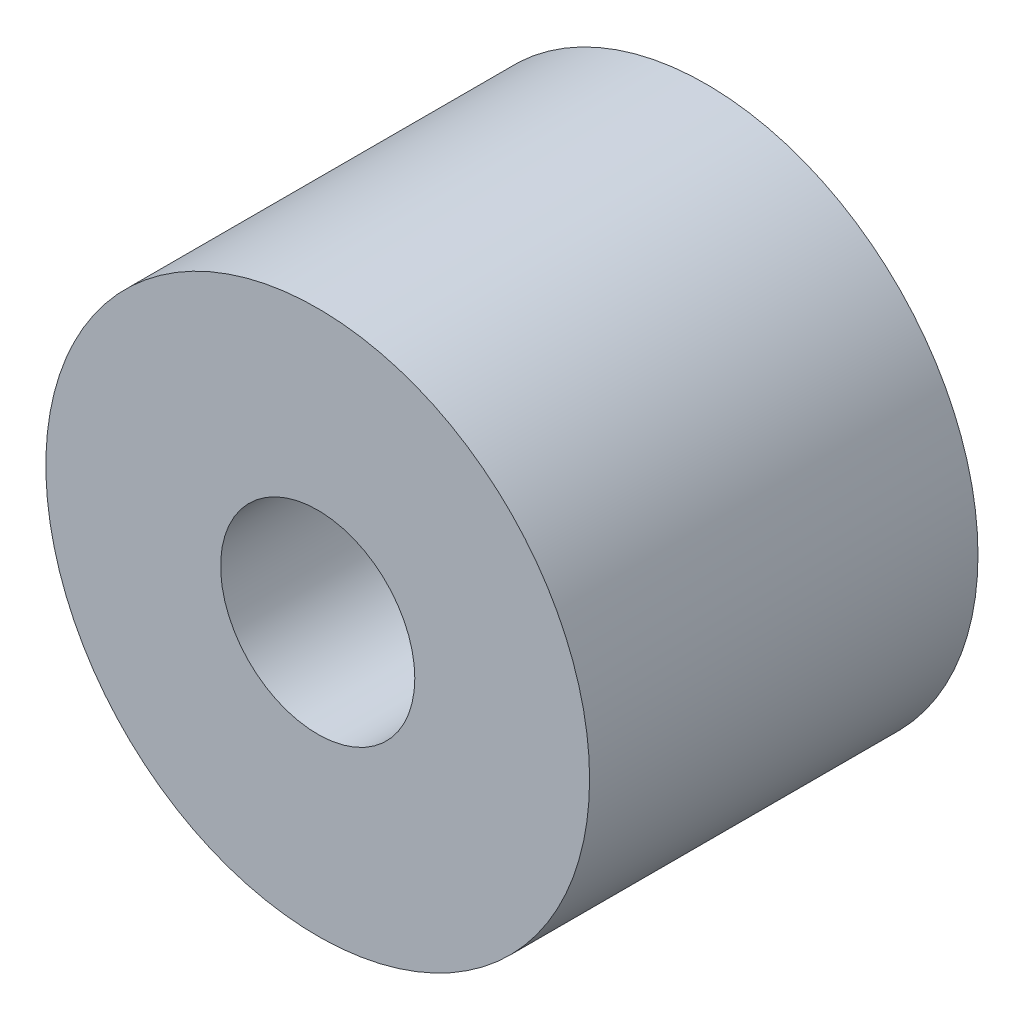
from build123d import *

# Parameters (mm, degrees)
SKETCH1_R           = 4.445
SKETCH1_R_2         = 1.5875
BOSS_EXTRUDE1_DEPTH = 6.35


with BuildPart() as part:
    # Sketch1 → Boss-Extrude1 (new body)
    with BuildSketch(Plane.XY):
        Circle(SKETCH1_R)
        Circle(SKETCH1_R_2, mode=Mode.SUBTRACT)
    extrude(amount=BOSS_EXTRUDE1_DEPTH)


solid = part.part
